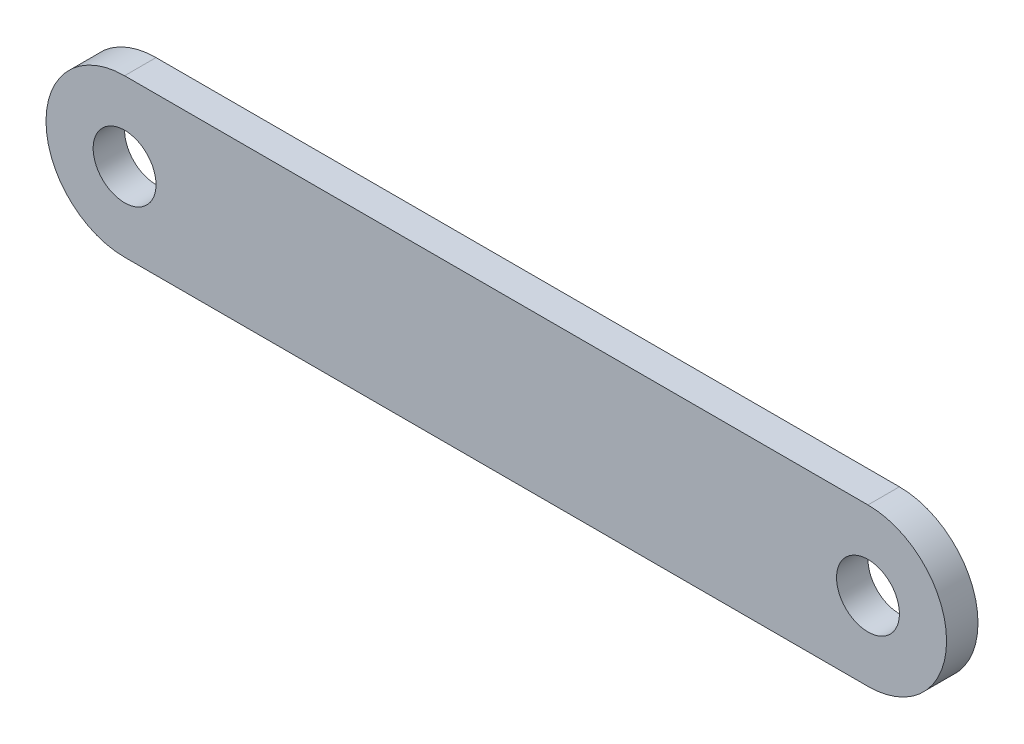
ISO-10303-21;
HEADER;
FILE_DESCRIPTION(('STEP AP214'),'2;1');
FILE_NAME('part.step','',(''),(''),'','','');
FILE_SCHEMA(('AUTOMOTIVE_DESIGN { 1 0 10303 214 1 1 1 1 }'));
ENDSEC;
DATA;
#1=APPLICATION_CONTEXT('core data for automotive mechanical design processes');
#2=APPLICATION_PROTOCOL_DEFINITION('international standard','automotive_design',2000,#1);
#3=PRODUCT_CONTEXT('',#1,'mechanical');
#4=PRODUCT('Part','Part','',(#3));
#5=PRODUCT_RELATED_PRODUCT_CATEGORY('part','',(#4));
#6=PRODUCT_DEFINITION_FORMATION('','',#4);
#7=PRODUCT_DEFINITION_CONTEXT('part definition',#1,'design');
#8=PRODUCT_DEFINITION('design','',#6,#7);
#9=PRODUCT_DEFINITION_SHAPE('','',#8);
#10=(LENGTH_UNIT() NAMED_UNIT(*) SI_UNIT(.MILLI.,.METRE.));
#11=(NAMED_UNIT(*) PLANE_ANGLE_UNIT() SI_UNIT($,.RADIAN.));
#12=(NAMED_UNIT(*) SI_UNIT($,.STERADIAN.) SOLID_ANGLE_UNIT());
#13=UNCERTAINTY_MEASURE_WITH_UNIT(LENGTH_MEASURE(1.E-05),#10,'distance_accuracy_value','');
#14=(GEOMETRIC_REPRESENTATION_CONTEXT(3) GLOBAL_UNCERTAINTY_ASSIGNED_CONTEXT((#13)) GLOBAL_UNIT_ASSIGNED_CONTEXT((#10,
#11,#12)) REPRESENTATION_CONTEXT('',''));
#15=CARTESIAN_POINT('',(0.,0.,0.));
#16=DIRECTION('',(0.,0.,1.));
#17=DIRECTION('',(1.,0.,0.));
#18=AXIS2_PLACEMENT_3D('',#15,#16,#17);
#19=CARTESIAN_POINT('',(-59.1203697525,0.,5.));
#20=DIRECTION('',(0.,0.,-1.));
#21=DIRECTION('',(-1.,0.,0.));
#22=AXIS2_PLACEMENT_3D('',#19,#20,#21);
#23=CYLINDRICAL_SURFACE('',#22,12.5);
#24=CARTESIAN_POINT('',(-59.1203697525,0.,0.));
#25=DIRECTION('',(0.,0.,1.));
#26=DIRECTION('',(1.,0.,0.));
#27=AXIS2_PLACEMENT_3D('',#24,#25,#26);
#28=CIRCLE('',#27,12.5);
#29=CARTESIAN_POINT('',(-59.1203697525,12.5,0.));
#30=VERTEX_POINT('',#29);
#31=CARTESIAN_POINT('',(-59.1203697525,-12.5,0.));
#32=VERTEX_POINT('',#31);
#33=EDGE_CURVE('E95',#30,#32,#28,.T.);
#34=ORIENTED_EDGE('',*,*,#33,.T.);
#35=DIRECTION('',(0.,0.,-1.));
#36=VECTOR('',#35,1.);
#37=CARTESIAN_POINT('',(-59.1203697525,-12.5,5.));
#38=LINE('',#37,#36);
#39=CARTESIAN_POINT('',(-59.1203697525,-12.5,5.));
#40=VERTEX_POINT('',#39);
#41=EDGE_CURVE('E11',#40,#32,#38,.T.);
#42=ORIENTED_EDGE('',*,*,#41,.F.);
#43=CARTESIAN_POINT('',(-59.1203697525,0.,5.));
#44=DIRECTION('',(0.,0.,1.));
#45=DIRECTION('',(1.,0.,0.));
#46=AXIS2_PLACEMENT_3D('',#43,#44,#45);
#47=CIRCLE('',#46,12.5);
#48=CARTESIAN_POINT('',(-59.1203697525,12.5,5.));
#49=VERTEX_POINT('',#48);
#50=EDGE_CURVE('E83',#49,#40,#47,.T.);
#51=ORIENTED_EDGE('',*,*,#50,.F.);
#52=DIRECTION('',(0.,0.,-1.));
#53=VECTOR('',#52,1.);
#54=CARTESIAN_POINT('',(-59.1203697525,12.5,5.));
#55=LINE('',#54,#53);
#56=EDGE_CURVE('E91',#49,#30,#55,.T.);
#57=ORIENTED_EDGE('',*,*,#56,.T.);
#58=EDGE_LOOP('',(#34,#42,#51,#57));
#59=FACE_BOUND('',#58,.T.);
#60=ADVANCED_FACE('F32',(#59),#23,.T.);
#61=CARTESIAN_POINT('',(-59.1203697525,-12.5,5.));
#62=DIRECTION('',(0.,1.,0.));
#63=DIRECTION('',(-1.,0.,0.));
#64=AXIS2_PLACEMENT_3D('',#61,#62,#63);
#65=PLANE('',#64);
#66=DIRECTION('',(1.,0.,0.));
#67=VECTOR('',#66,1.);
#68=CARTESIAN_POINT('',(-59.1203697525,-12.5,0.));
#69=LINE('',#68,#67);
#70=CARTESIAN_POINT('',(59.1203697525,-12.5,0.));
#71=VERTEX_POINT('',#70);
#72=EDGE_CURVE('E87',#32,#71,#69,.T.);
#73=ORIENTED_EDGE('',*,*,#72,.T.);
#74=DIRECTION('',(0.,0.,-1.));
#75=VECTOR('',#74,1.);
#76=CARTESIAN_POINT('',(59.1203697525,-12.5,5.));
#77=LINE('',#76,#75);
#78=CARTESIAN_POINT('',(59.1203697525,-12.5,5.));
#79=VERTEX_POINT('',#78);
#80=EDGE_CURVE('E40',#79,#71,#77,.T.);
#81=ORIENTED_EDGE('',*,*,#80,.F.);
#82=DIRECTION('',(1.,0.,0.));
#83=VECTOR('',#82,1.);
#84=CARTESIAN_POINT('',(-59.1203697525,-12.5,5.));
#85=LINE('',#84,#83);
#86=EDGE_CURVE('E78',#40,#79,#85,.T.);
#87=ORIENTED_EDGE('',*,*,#86,.F.);
#88=ORIENTED_EDGE('',*,*,#41,.T.);
#89=EDGE_LOOP('',(#73,#81,#87,#88));
#90=FACE_BOUND('',#89,.T.);
#91=ADVANCED_FACE('F86',(#90),#65,.F.);
#92=CARTESIAN_POINT('',(59.1203697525,0.,5.));
#93=DIRECTION('',(0.,0.,-1.));
#94=DIRECTION('',(-1.,0.,0.));
#95=AXIS2_PLACEMENT_3D('',#92,#93,#94);
#96=CYLINDRICAL_SURFACE('',#95,12.5);
#97=CARTESIAN_POINT('',(59.1203697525,0.,0.));
#98=DIRECTION('',(0.,0.,1.));
#99=DIRECTION('',(1.,0.,0.));
#100=AXIS2_PLACEMENT_3D('',#97,#98,#99);
#101=CIRCLE('',#100,12.5);
#102=CARTESIAN_POINT('',(59.1203697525,12.5,0.));
#103=VERTEX_POINT('',#102);
#104=EDGE_CURVE('E65',#71,#103,#101,.T.);
#105=ORIENTED_EDGE('',*,*,#104,.T.);
#106=DIRECTION('',(0.,0.,-1.));
#107=VECTOR('',#106,1.);
#108=CARTESIAN_POINT('',(59.1203697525,12.5,5.));
#109=LINE('',#108,#107);
#110=CARTESIAN_POINT('',(59.1203697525,12.5,5.));
#111=VERTEX_POINT('',#110);
#112=EDGE_CURVE('E88',#111,#103,#109,.T.);
#113=ORIENTED_EDGE('',*,*,#112,.F.);
#114=CARTESIAN_POINT('',(59.1203697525,0.,5.));
#115=DIRECTION('',(0.,0.,1.));
#116=DIRECTION('',(1.,0.,0.));
#117=AXIS2_PLACEMENT_3D('',#114,#115,#116);
#118=CIRCLE('',#117,12.5);
#119=EDGE_CURVE('E81',#79,#111,#118,.T.);
#120=ORIENTED_EDGE('',*,*,#119,.F.);
#121=ORIENTED_EDGE('',*,*,#80,.T.);
#122=EDGE_LOOP('',(#105,#113,#120,#121));
#123=FACE_BOUND('',#122,.T.);
#124=ADVANCED_FACE('F89',(#123),#96,.T.);
#125=CARTESIAN_POINT('',(-59.1203697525,12.5,5.));
#126=DIRECTION('',(0.,-1.,0.));
#127=DIRECTION('',(1.,0.,0.));
#128=AXIS2_PLACEMENT_3D('',#125,#126,#127);
#129=PLANE('',#128);
#130=DIRECTION('',(-1.,0.,0.));
#131=VECTOR('',#130,1.);
#132=CARTESIAN_POINT('',(-59.1203697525,12.5,0.));
#133=LINE('',#132,#131);
#134=EDGE_CURVE('E71',#103,#30,#133,.T.);
#135=ORIENTED_EDGE('',*,*,#134,.T.);
#136=ORIENTED_EDGE('',*,*,#56,.F.);
#137=DIRECTION('',(-1.,0.,0.));
#138=VECTOR('',#137,1.);
#139=CARTESIAN_POINT('',(-59.1203697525,12.5,5.));
#140=LINE('',#139,#138);
#141=EDGE_CURVE('E48',#111,#49,#140,.T.);
#142=ORIENTED_EDGE('',*,*,#141,.F.);
#143=ORIENTED_EDGE('',*,*,#112,.T.);
#144=EDGE_LOOP('',(#135,#136,#142,#143));
#145=FACE_BOUND('',#144,.T.);
#146=ADVANCED_FACE('F103',(#145),#129,.F.);
#147=CARTESIAN_POINT('',(-59.1203697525,0.,5.));
#148=DIRECTION('',(0.,0.,1.));
#149=DIRECTION('',(1.,0.,0.));
#150=AXIS2_PLACEMENT_3D('',#147,#148,#149);
#151=PLANE('',#150);
#152=CARTESIAN_POINT('',(-59.1203697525,0.,5.));
#153=DIRECTION('',(0.,0.,1.));
#154=DIRECTION('',(1.,0.,0.));
#155=AXIS2_PLACEMENT_3D('',#152,#153,#154);
#156=CIRCLE('',#155,5.);
#157=CARTESIAN_POINT('',(-54.1203697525,0.,5.));
#158=VERTEX_POINT('',#157);
#159=EDGE_CURVE('E117',#158,#158,#156,.T.);
#160=ORIENTED_EDGE('',*,*,#159,.F.);
#161=EDGE_LOOP('',(#160));
#162=FACE_BOUND('',#161,.T.);
#163=CARTESIAN_POINT('',(59.1203697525,0.,5.));
#164=DIRECTION('',(0.,0.,1.));
#165=DIRECTION('',(1.,0.,0.));
#166=AXIS2_PLACEMENT_3D('',#163,#164,#165);
#167=CIRCLE('',#166,5.);
#168=CARTESIAN_POINT('',(64.1203697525,0.,5.));
#169=VERTEX_POINT('',#168);
#170=EDGE_CURVE('E111',#169,#169,#167,.T.);
#171=ORIENTED_EDGE('',*,*,#170,.F.);
#172=EDGE_LOOP('',(#171));
#173=FACE_BOUND('',#172,.T.);
#174=ORIENTED_EDGE('',*,*,#50,.T.);
#175=ORIENTED_EDGE('',*,*,#86,.T.);
#176=ORIENTED_EDGE('',*,*,#119,.T.);
#177=ORIENTED_EDGE('',*,*,#141,.T.);
#178=EDGE_LOOP('',(#174,#175,#176,#177));
#179=FACE_BOUND('',#178,.T.);
#180=ADVANCED_FACE('F79',(#162,#173,#179),#151,.T.);
#181=CARTESIAN_POINT('',(-59.1203697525,0.,0.));
#182=DIRECTION('',(0.,0.,1.));
#183=DIRECTION('',(1.,0.,0.));
#184=AXIS2_PLACEMENT_3D('',#181,#182,#183);
#185=PLANE('',#184);
#186=CARTESIAN_POINT('',(-59.1203697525,0.,0.));
#187=DIRECTION('',(0.,0.,1.));
#188=DIRECTION('',(1.,0.,0.));
#189=AXIS2_PLACEMENT_3D('',#186,#187,#188);
#190=CIRCLE('',#189,5.);
#191=CARTESIAN_POINT('',(-54.1203697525,0.,0.));
#192=VERTEX_POINT('',#191);
#193=EDGE_CURVE('E114',#192,#192,#190,.T.);
#194=ORIENTED_EDGE('',*,*,#193,.T.);
#195=EDGE_LOOP('',(#194));
#196=FACE_BOUND('',#195,.T.);
#197=CARTESIAN_POINT('',(59.1203697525,0.,0.));
#198=DIRECTION('',(0.,0.,1.));
#199=DIRECTION('',(1.,0.,0.));
#200=AXIS2_PLACEMENT_3D('',#197,#198,#199);
#201=CIRCLE('',#200,5.);
#202=CARTESIAN_POINT('',(64.1203697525,0.,0.));
#203=VERTEX_POINT('',#202);
#204=EDGE_CURVE('E98',#203,#203,#201,.T.);
#205=ORIENTED_EDGE('',*,*,#204,.T.);
#206=EDGE_LOOP('',(#205));
#207=FACE_BOUND('',#206,.T.);
#208=ORIENTED_EDGE('',*,*,#33,.F.);
#209=ORIENTED_EDGE('',*,*,#134,.F.);
#210=ORIENTED_EDGE('',*,*,#104,.F.);
#211=ORIENTED_EDGE('',*,*,#72,.F.);
#212=EDGE_LOOP('',(#208,#209,#210,#211));
#213=FACE_BOUND('',#212,.T.);
#214=ADVANCED_FACE('F106',(#196,#207,#213),#185,.F.);
#215=CARTESIAN_POINT('',(59.1203697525,0.,5.));
#216=DIRECTION('',(0.,0.,1.));
#217=DIRECTION('',(1.,0.,0.));
#218=AXIS2_PLACEMENT_3D('',#215,#216,#217);
#219=CYLINDRICAL_SURFACE('',#218,5.);
#220=ORIENTED_EDGE('',*,*,#204,.F.);
#221=EDGE_LOOP('',(#220));
#222=FACE_BOUND('',#221,.T.);
#223=ORIENTED_EDGE('',*,*,#170,.T.);
#224=EDGE_LOOP('',(#223));
#225=FACE_BOUND('',#224,.T.);
#226=ADVANCED_FACE('F128',(#222,#225),#219,.F.);
#227=CARTESIAN_POINT('',(-59.1203697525,0.,5.));
#228=DIRECTION('',(0.,0.,1.));
#229=DIRECTION('',(1.,0.,0.));
#230=AXIS2_PLACEMENT_3D('',#227,#228,#229);
#231=CYLINDRICAL_SURFACE('',#230,5.);
#232=ORIENTED_EDGE('',*,*,#193,.F.);
#233=EDGE_LOOP('',(#232));
#234=FACE_BOUND('',#233,.T.);
#235=ORIENTED_EDGE('',*,*,#159,.T.);
#236=EDGE_LOOP('',(#235));
#237=FACE_BOUND('',#236,.T.);
#238=ADVANCED_FACE('F121',(#234,#237),#231,.F.);
#239=CLOSED_SHELL('',(#60,#91,#124,#146,#180,#214,#226,#238));
#240=MANIFOLD_SOLID_BREP('B2',#239);
#241=ADVANCED_BREP_SHAPE_REPRESENTATION('',(#18,#240),#14);
#242=SHAPE_DEFINITION_REPRESENTATION(#9,#241);
ENDSEC;
END-ISO-10303-21;
